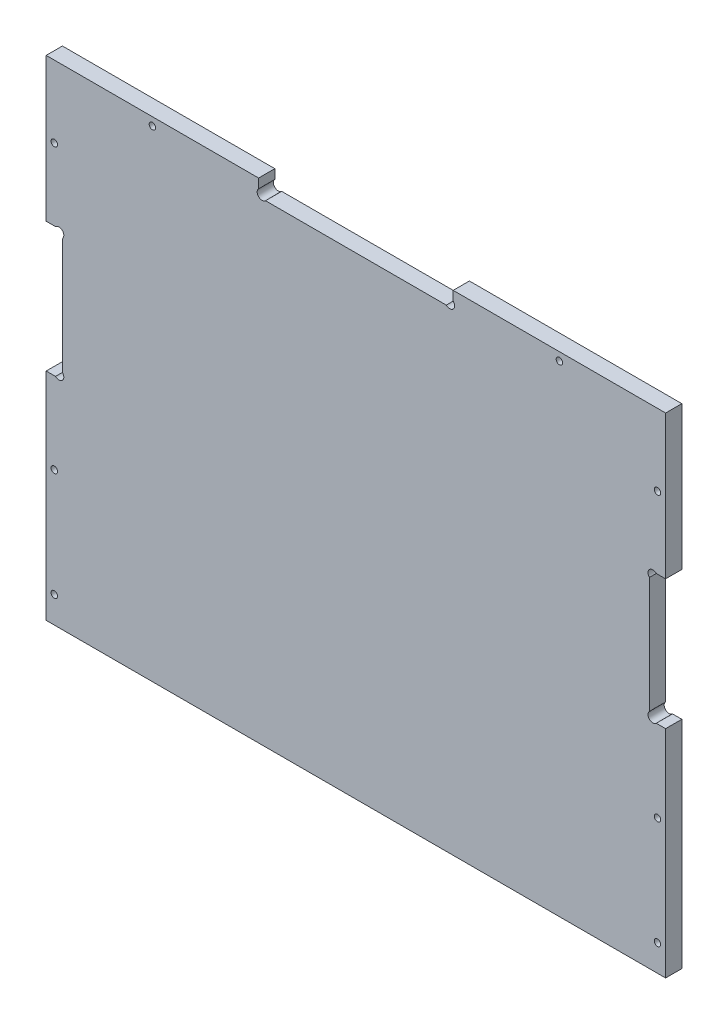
from build123d import *

# Parameters (mm, degrees)
ESQUISSE1_R        = 1
BOSS_EXTRU_1_DEPTH = 5


with BuildPart() as part:
    # Esquisse1 → Boss.-Extru.1 (new body)
    with BuildSketch(Plane.XY):
        with BuildLine():
            Line((-95.5, -113.433124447), (95.5, -113.433124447))
            Line((95.5, -113.433124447), (95.5, -46.843124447))
            Line((95.5, -46.843124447), (92.621320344, -46.843124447))
            ThreePointArc((92.621320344, -46.843124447), (90.5, -46.843124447), (90.5, -44.721804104))
            Line((90.5, -44.721804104), (90.5, -8.964444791))
            ThreePointArc((90.5, -8.964444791), (90.5, -6.843124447), (92.621320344, -6.843124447))
            Line((92.621320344, -6.843124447), (95.5, -6.843124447))
            Line((95.5, -6.843124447), (95.5, 37.446875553))
            Line((95.5, 37.446875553), (30, 37.446875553))
            Line((30, 37.446875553), (30, 34.568195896))
            ThreePointArc((30, 34.568195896), (30, 32.446875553), (27.878679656, 32.446875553))
            Line((27.878679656, 32.446875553), (-27.878679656, 32.446875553))
            ThreePointArc((-27.878679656, 32.446875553), (-30, 32.446875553), (-30, 34.568195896))
            Line((-30, 34.568195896), (-30, 37.446875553))
            Line((-30, 37.446875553), (-95.5, 37.446875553))
            Line((-95.5, 37.446875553), (-95.5, -6.843124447))
            Line((-95.5, -6.843124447), (-92.621320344, -6.843124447))
            ThreePointArc((-92.621320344, -6.843124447), (-90.5, -6.843124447), (-90.5, -8.964444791))
            Line((-90.5, -8.964444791), (-90.5, -44.721804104))
            ThreePointArc((-90.5, -44.721804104), (-90.5, -46.843124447), (-92.621320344, -46.843124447))
            Line((-92.621320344, -46.843124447), (-95.5, -46.843124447))
            Line((-95.5, -46.843124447), (-95.5, -113.433124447))
        make_face()
        with Locations((93, 15.301875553)):
            Circle(ESQUISSE1_R, mode=Mode.SUBTRACT)
        with Locations((-93, -71.958124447)):
            Circle(ESQUISSE1_R, mode=Mode.SUBTRACT)
        with Locations((-93, -105.253124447)):
            Circle(ESQUISSE1_R, mode=Mode.SUBTRACT)
        with Locations((-62.75, 34.946875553)):
            Circle(ESQUISSE1_R, mode=Mode.SUBTRACT)
        with Locations((-93, 15.301875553)):
            Circle(ESQUISSE1_R, mode=Mode.SUBTRACT)
        with Locations((62.75, 34.946875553)):
            Circle(ESQUISSE1_R, mode=Mode.SUBTRACT)
        with Locations((93, -105.253124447)):
            Circle(ESQUISSE1_R, mode=Mode.SUBTRACT)
        with Locations((93, -71.958124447)):
            Circle(ESQUISSE1_R, mode=Mode.SUBTRACT)
    extrude(amount=BOSS_EXTRU_1_DEPTH)


solid = part.part
